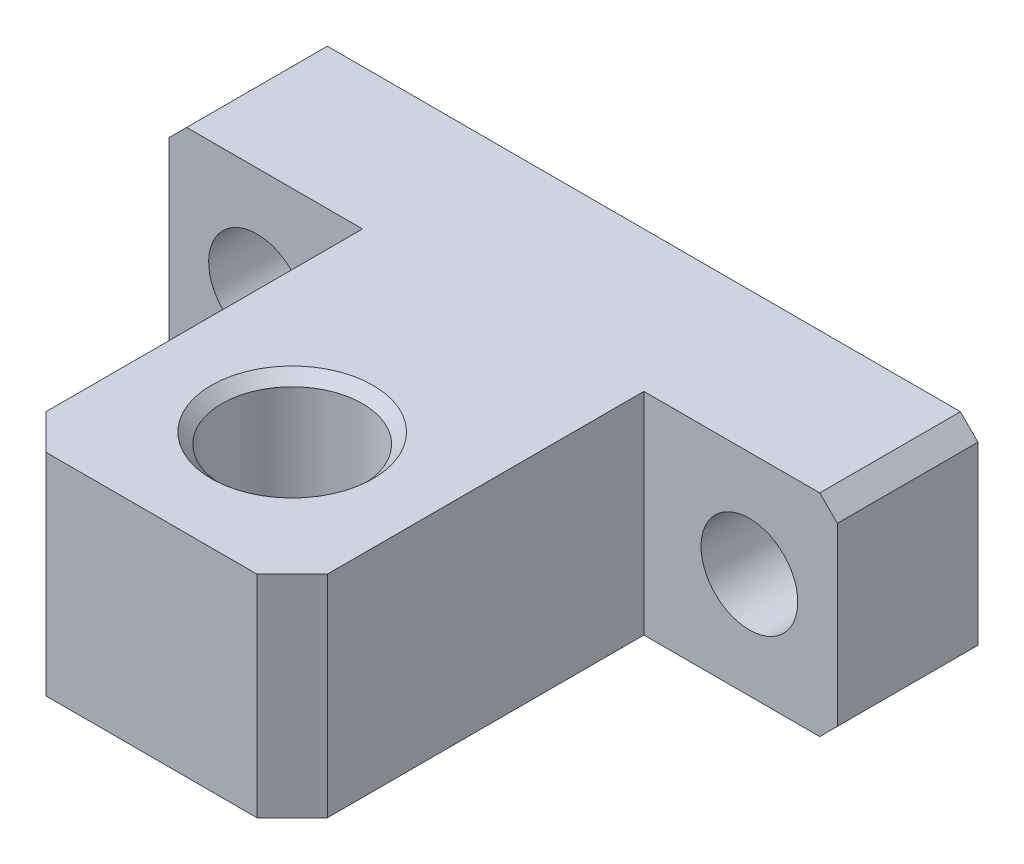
ISO-10303-21;
HEADER;
FILE_DESCRIPTION(('STEP AP214'),'2;1');
FILE_NAME('part.step','',(''),(''),'','','');
FILE_SCHEMA(('AUTOMOTIVE_DESIGN { 1 0 10303 214 1 1 1 1 }'));
ENDSEC;
DATA;
#1=APPLICATION_CONTEXT('core data for automotive mechanical design processes');
#2=APPLICATION_PROTOCOL_DEFINITION('international standard','automotive_design',2000,#1);
#3=PRODUCT_CONTEXT('',#1,'mechanical');
#4=PRODUCT('Part','Part','',(#3));
#5=PRODUCT_RELATED_PRODUCT_CATEGORY('part','',(#4));
#6=PRODUCT_DEFINITION_FORMATION('','',#4);
#7=PRODUCT_DEFINITION_CONTEXT('part definition',#1,'design');
#8=PRODUCT_DEFINITION('design','',#6,#7);
#9=PRODUCT_DEFINITION_SHAPE('','',#8);
#10=(LENGTH_UNIT() NAMED_UNIT(*) SI_UNIT(.MILLI.,.METRE.));
#11=(NAMED_UNIT(*) PLANE_ANGLE_UNIT() SI_UNIT($,.RADIAN.));
#12=(NAMED_UNIT(*) SI_UNIT($,.STERADIAN.) SOLID_ANGLE_UNIT());
#13=UNCERTAINTY_MEASURE_WITH_UNIT(LENGTH_MEASURE(1.E-05),#10,'distance_accuracy_value','');
#14=(GEOMETRIC_REPRESENTATION_CONTEXT(3) GLOBAL_UNCERTAINTY_ASSIGNED_CONTEXT((#13)) GLOBAL_UNIT_ASSIGNED_CONTEXT((#10,
#11,#12)) REPRESENTATION_CONTEXT('',''));
#15=CARTESIAN_POINT('',(0.,0.,0.));
#16=DIRECTION('',(0.,0.,1.));
#17=DIRECTION('',(1.,0.,0.));
#18=AXIS2_PLACEMENT_3D('',#15,#16,#17);
#19=CARTESIAN_POINT('',(-5.,6.,8.));
#20=DIRECTION('',(-1.,0.,0.));
#21=DIRECTION('',(0.,0.,-1.));
#22=AXIS2_PLACEMENT_3D('',#19,#20,#21);
#23=PLANE('',#22);
#24=DIRECTION('',(0.,-1.,0.));
#25=VECTOR('',#24,1.);
#26=CARTESIAN_POINT('',(-5.,6.,0.));
#27=LINE('',#26,#25);
#28=CARTESIAN_POINT('',(-5.,5.,0.));
#29=VERTEX_POINT('',#28);
#30=CARTESIAN_POINT('',(-5.,-5.,0.));
#31=VERTEX_POINT('',#30);
#32=EDGE_CURVE('E152',#29,#31,#27,.T.);
#33=ORIENTED_EDGE('',*,*,#32,.T.);
#34=DIRECTION('',(0.,0.,1.));
#35=VECTOR('',#34,1.);
#36=CARTESIAN_POINT('',(-5.,-5.,8.));
#37=LINE('',#36,#35);
#38=CARTESIAN_POINT('',(-5.,-5.,8.));
#39=VERTEX_POINT('',#38);
#40=EDGE_CURVE('E209',#31,#39,#37,.T.);
#41=ORIENTED_EDGE('',*,*,#40,.T.);
#42=DIRECTION('',(0.,-1.,0.));
#43=VECTOR('',#42,1.);
#44=CARTESIAN_POINT('',(-5.,6.,8.));
#45=LINE('',#44,#43);
#46=CARTESIAN_POINT('',(-5.,5.,8.));
#47=VERTEX_POINT('',#46);
#48=EDGE_CURVE('E168',#47,#39,#45,.T.);
#49=ORIENTED_EDGE('',*,*,#48,.F.);
#50=DIRECTION('',(0.,0.,-1.));
#51=VECTOR('',#50,1.);
#52=CARTESIAN_POINT('',(-5.,5.,8.));
#53=LINE('',#52,#51);
#54=EDGE_CURVE('E206',#47,#29,#53,.T.);
#55=ORIENTED_EDGE('',*,*,#54,.T.);
#56=EDGE_LOOP('',(#33,#41,#49,#55));
#57=FACE_BOUND('',#56,.T.);
#58=ADVANCED_FACE('F14',(#57),#23,.T.);
#59=CARTESIAN_POINT('',(6.,6.,8.));
#60=DIRECTION('',(0.,0.,1.));
#61=DIRECTION('',(-1.,0.,0.));
#62=AXIS2_PLACEMENT_3D('',#59,#60,#61);
#63=PLANE('',#62);
#64=CARTESIAN_POINT('',(0.,0.,8.));
#65=DIRECTION('',(0.,0.,1.));
#66=DIRECTION('',(0.,-1.,0.));
#67=AXIS2_PLACEMENT_3D('',#64,#65,#66);
#68=CIRCLE('',#67,2.75);
#69=CARTESIAN_POINT('',(0.,-2.75,8.));
#70=VERTEX_POINT('',#69);
#71=EDGE_CURVE('E317',#70,#70,#68,.T.);
#72=ORIENTED_EDGE('',*,*,#71,.F.);
#73=EDGE_LOOP('',(#72));
#74=FACE_BOUND('',#73,.T.);
#75=ORIENTED_EDGE('',*,*,#48,.T.);
#76=DIRECTION('',(0.707106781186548,-0.707106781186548,0.));
#77=VECTOR('',#76,1.);
#78=CARTESIAN_POINT('',(-5.,-5.,8.));
#79=LINE('',#78,#77);
#80=CARTESIAN_POINT('',(-4.,-6.,8.));
#81=VERTEX_POINT('',#80);
#82=EDGE_CURVE('E213',#39,#81,#79,.T.);
#83=ORIENTED_EDGE('',*,*,#82,.T.);
#84=DIRECTION('',(-1.,0.,0.));
#85=VECTOR('',#84,1.);
#86=CARTESIAN_POINT('',(6.,-6.,8.));
#87=LINE('',#86,#85);
#88=CARTESIAN_POINT('',(6.,-6.,8.));
#89=VERTEX_POINT('',#88);
#90=EDGE_CURVE('E165',#89,#81,#87,.T.);
#91=ORIENTED_EDGE('',*,*,#90,.F.);
#92=DIRECTION('',(0.,-1.,0.));
#93=VECTOR('',#92,1.);
#94=CARTESIAN_POINT('',(6.,6.,8.));
#95=LINE('',#94,#93);
#96=CARTESIAN_POINT('',(6.,6.,8.));
#97=VERTEX_POINT('',#96);
#98=EDGE_CURVE('E137',#97,#89,#95,.T.);
#99=ORIENTED_EDGE('',*,*,#98,.F.);
#100=DIRECTION('',(-1.,0.,0.));
#101=VECTOR('',#100,1.);
#102=CARTESIAN_POINT('',(6.,6.,8.));
#103=LINE('',#102,#101);
#104=CARTESIAN_POINT('',(-4.,6.,8.));
#105=VERTEX_POINT('',#104);
#106=EDGE_CURVE('E149',#97,#105,#103,.T.);
#107=ORIENTED_EDGE('',*,*,#106,.T.);
#108=DIRECTION('',(0.707106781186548,0.707106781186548,0.));
#109=VECTOR('',#108,1.);
#110=CARTESIAN_POINT('',(1.,11.,8.));
#111=LINE('',#110,#109);
#112=EDGE_CURVE('E211',#105,#47,#111,.F.);
#113=ORIENTED_EDGE('',*,*,#112,.T.);
#114=EDGE_LOOP('',(#75,#83,#91,#99,#107,#113));
#115=FACE_BOUND('',#114,.T.);
#116=ADVANCED_FACE('F250',(#74,#115),#63,.T.);
#117=CARTESIAN_POINT('',(6.,6.,28.));
#118=DIRECTION('',(-1.,0.,0.));
#119=DIRECTION('',(0.,0.,-1.));
#120=AXIS2_PLACEMENT_3D('',#117,#118,#119);
#121=PLANE('',#120);
#122=DIRECTION('',(0.,0.,-1.));
#123=VECTOR('',#122,1.);
#124=CARTESIAN_POINT('',(6.,-6.,28.));
#125=LINE('',#124,#123);
#126=CARTESIAN_POINT('',(6.,-6.,26.));
#127=VERTEX_POINT('',#126);
#128=EDGE_CURVE('E163',#127,#89,#125,.T.);
#129=ORIENTED_EDGE('',*,*,#128,.F.);
#130=DIRECTION('',(0.,1.,0.));
#131=VECTOR('',#130,1.);
#132=CARTESIAN_POINT('',(6.,6.,26.));
#133=LINE('',#132,#131);
#134=CARTESIAN_POINT('',(6.,6.,26.));
#135=VERTEX_POINT('',#134);
#136=EDGE_CURVE('E38',#127,#135,#133,.T.);
#137=ORIENTED_EDGE('',*,*,#136,.T.);
#138=DIRECTION('',(0.,0.,-1.));
#139=VECTOR('',#138,1.);
#140=CARTESIAN_POINT('',(6.,6.,28.));
#141=LINE('',#140,#139);
#142=EDGE_CURVE('E144',#135,#97,#141,.T.);
#143=ORIENTED_EDGE('',*,*,#142,.T.);
#144=ORIENTED_EDGE('',*,*,#98,.T.);
#145=EDGE_LOOP('',(#129,#137,#143,#144));
#146=FACE_BOUND('',#145,.T.);
#147=ADVANCED_FACE('F256',(#146),#121,.T.);
#148=CARTESIAN_POINT('',(22.,6.,28.));
#149=DIRECTION('',(0.,0.,1.));
#150=DIRECTION('',(0.,-1.,0.));
#151=AXIS2_PLACEMENT_3D('',#148,#149,#150);
#152=PLANE('',#151);
#153=DIRECTION('',(-1.,0.,0.));
#154=VECTOR('',#153,1.);
#155=CARTESIAN_POINT('',(22.,6.,28.));
#156=LINE('',#155,#154);
#157=CARTESIAN_POINT('',(20.,6.,28.));
#158=VERTEX_POINT('',#157);
#159=CARTESIAN_POINT('',(8.,6.,28.));
#160=VERTEX_POINT('',#159);
#161=EDGE_CURVE('E141',#158,#160,#156,.T.);
#162=ORIENTED_EDGE('',*,*,#161,.T.);
#163=DIRECTION('',(0.,-1.,0.));
#164=VECTOR('',#163,1.);
#165=CARTESIAN_POINT('',(8.,6.,28.));
#166=LINE('',#165,#164);
#167=CARTESIAN_POINT('',(8.,-6.,28.));
#168=VERTEX_POINT('',#167);
#169=EDGE_CURVE('E217',#160,#168,#166,.T.);
#170=ORIENTED_EDGE('',*,*,#169,.T.);
#171=DIRECTION('',(-1.,0.,0.));
#172=VECTOR('',#171,1.);
#173=CARTESIAN_POINT('',(22.,-6.,28.));
#174=LINE('',#173,#172);
#175=CARTESIAN_POINT('',(20.,-6.,28.));
#176=VERTEX_POINT('',#175);
#177=EDGE_CURVE('E160',#176,#168,#174,.T.);
#178=ORIENTED_EDGE('',*,*,#177,.F.);
#179=DIRECTION('',(0.,1.,0.));
#180=VECTOR('',#179,1.);
#181=CARTESIAN_POINT('',(20.,6.,28.));
#182=LINE('',#181,#180);
#183=EDGE_CURVE('E215',#176,#158,#182,.T.);
#184=ORIENTED_EDGE('',*,*,#183,.T.);
#185=EDGE_LOOP('',(#162,#170,#178,#184));
#186=FACE_BOUND('',#185,.T.);
#187=ADVANCED_FACE('F288',(#186),#152,.T.);
#188=CARTESIAN_POINT('',(22.,6.,8.));
#189=DIRECTION('',(1.,0.,0.));
#190=DIRECTION('',(0.,0.,1.));
#191=AXIS2_PLACEMENT_3D('',#188,#189,#190);
#192=PLANE('',#191);
#193=DIRECTION('',(0.,0.,1.));
#194=VECTOR('',#193,1.);
#195=CARTESIAN_POINT('',(22.,6.,8.));
#196=LINE('',#195,#194);
#197=CARTESIAN_POINT('',(22.,6.,8.));
#198=VERTEX_POINT('',#197);
#199=CARTESIAN_POINT('',(22.,6.,26.));
#200=VERTEX_POINT('',#199);
#201=EDGE_CURVE('E128',#198,#200,#196,.T.);
#202=ORIENTED_EDGE('',*,*,#201,.T.);
#203=DIRECTION('',(0.,-1.,0.));
#204=VECTOR('',#203,1.);
#205=CARTESIAN_POINT('',(22.,6.,26.));
#206=LINE('',#205,#204);
#207=CARTESIAN_POINT('',(22.,-6.,26.));
#208=VERTEX_POINT('',#207);
#209=EDGE_CURVE('E228',#200,#208,#206,.T.);
#210=ORIENTED_EDGE('',*,*,#209,.T.);
#211=DIRECTION('',(0.,0.,1.));
#212=VECTOR('',#211,1.);
#213=CARTESIAN_POINT('',(22.,-6.,8.));
#214=LINE('',#213,#212);
#215=CARTESIAN_POINT('',(22.,-6.,8.));
#216=VERTEX_POINT('',#215);
#217=EDGE_CURVE('E136',#216,#208,#214,.T.);
#218=ORIENTED_EDGE('',*,*,#217,.F.);
#219=DIRECTION('',(0.,-1.,0.));
#220=VECTOR('',#219,1.);
#221=CARTESIAN_POINT('',(22.,6.,8.));
#222=LINE('',#221,#220);
#223=EDGE_CURVE('E123',#198,#216,#222,.T.);
#224=ORIENTED_EDGE('',*,*,#223,.F.);
#225=EDGE_LOOP('',(#202,#210,#218,#224));
#226=FACE_BOUND('',#225,.T.);
#227=ADVANCED_FACE('F132',(#226),#192,.T.);
#228=CARTESIAN_POINT('',(33.,6.,8.));
#229=DIRECTION('',(0.,0.,1.));
#230=DIRECTION('',(-1.,0.,0.));
#231=AXIS2_PLACEMENT_3D('',#228,#229,#230);
#232=PLANE('',#231);
#233=CARTESIAN_POINT('',(28.,0.,8.));
#234=DIRECTION('',(0.,0.,1.));
#235=DIRECTION('',(0.,-1.,0.));
#236=AXIS2_PLACEMENT_3D('',#233,#234,#235);
#237=CIRCLE('',#236,2.75);
#238=CARTESIAN_POINT('',(28.,-2.75,8.));
#239=VERTEX_POINT('',#238);
#240=EDGE_CURVE('E323',#239,#239,#237,.T.);
#241=ORIENTED_EDGE('',*,*,#240,.F.);
#242=EDGE_LOOP('',(#241));
#243=FACE_BOUND('',#242,.T.);
#244=DIRECTION('',(-1.,0.,0.));
#245=VECTOR('',#244,1.);
#246=CARTESIAN_POINT('',(33.,-6.,8.));
#247=LINE('',#246,#245);
#248=CARTESIAN_POINT('',(32.,-6.,8.));
#249=VERTEX_POINT('',#248);
#250=EDGE_CURVE('E156',#249,#216,#247,.T.);
#251=ORIENTED_EDGE('',*,*,#250,.F.);
#252=DIRECTION('',(0.70710678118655,0.707106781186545,0.));
#253=VECTOR('',#252,1.);
#254=CARTESIAN_POINT('',(38.5,0.499999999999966,8.));
#255=LINE('',#254,#253);
#256=CARTESIAN_POINT('',(33.,-5.,8.));
#257=VERTEX_POINT('',#256);
#258=EDGE_CURVE('E187',#249,#257,#255,.T.);
#259=ORIENTED_EDGE('',*,*,#258,.T.);
#260=DIRECTION('',(0.,-1.,0.));
#261=VECTOR('',#260,1.);
#262=CARTESIAN_POINT('',(33.,6.,8.));
#263=LINE('',#262,#261);
#264=CARTESIAN_POINT('',(33.,5.,8.));
#265=VERTEX_POINT('',#264);
#266=EDGE_CURVE('E138',#265,#257,#263,.T.);
#267=ORIENTED_EDGE('',*,*,#266,.F.);
#268=DIRECTION('',(0.707106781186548,-0.707106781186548,0.));
#269=VECTOR('',#268,1.);
#270=CARTESIAN_POINT('',(32.5,5.5,8.));
#271=LINE('',#270,#269);
#272=CARTESIAN_POINT('',(32.,6.,8.));
#273=VERTEX_POINT('',#272);
#274=EDGE_CURVE('E126',#265,#273,#271,.F.);
#275=ORIENTED_EDGE('',*,*,#274,.T.);
#276=DIRECTION('',(-1.,0.,0.));
#277=VECTOR('',#276,1.);
#278=CARTESIAN_POINT('',(33.,6.,8.));
#279=LINE('',#278,#277);
#280=EDGE_CURVE('E119',#273,#198,#279,.T.);
#281=ORIENTED_EDGE('',*,*,#280,.T.);
#282=ORIENTED_EDGE('',*,*,#223,.T.);
#283=EDGE_LOOP('',(#251,#259,#267,#275,#281,#282));
#284=FACE_BOUND('',#283,.T.);
#285=ADVANCED_FACE('F122',(#243,#284),#232,.T.);
#286=CARTESIAN_POINT('',(33.,6.,0.));
#287=DIRECTION('',(1.,0.,0.));
#288=DIRECTION('',(0.,0.,1.));
#289=AXIS2_PLACEMENT_3D('',#286,#287,#288);
#290=PLANE('',#289);
#291=ORIENTED_EDGE('',*,*,#266,.T.);
#292=DIRECTION('',(0.,0.,-1.));
#293=VECTOR('',#292,1.);
#294=CARTESIAN_POINT('',(33.,-5.,0.));
#295=LINE('',#294,#293);
#296=CARTESIAN_POINT('',(33.,-5.,0.));
#297=VERTEX_POINT('',#296);
#298=EDGE_CURVE('E192',#257,#297,#295,.T.);
#299=ORIENTED_EDGE('',*,*,#298,.T.);
#300=DIRECTION('',(0.,-1.,0.));
#301=VECTOR('',#300,1.);
#302=CARTESIAN_POINT('',(33.,6.,0.));
#303=LINE('',#302,#301);
#304=CARTESIAN_POINT('',(33.,5.,0.));
#305=VERTEX_POINT('',#304);
#306=EDGE_CURVE('E176',#305,#297,#303,.T.);
#307=ORIENTED_EDGE('',*,*,#306,.F.);
#308=DIRECTION('',(0.,0.,1.));
#309=VECTOR('',#308,1.);
#310=CARTESIAN_POINT('',(33.,5.,0.));
#311=LINE('',#310,#309);
#312=EDGE_CURVE('E189',#305,#265,#311,.T.);
#313=ORIENTED_EDGE('',*,*,#312,.T.);
#314=EDGE_LOOP('',(#291,#299,#307,#313));
#315=FACE_BOUND('',#314,.T.);
#316=ADVANCED_FACE('F296',(#315),#290,.T.);
#317=CARTESIAN_POINT('',(-5.,6.,0.));
#318=DIRECTION('',(0.,0.,-1.));
#319=DIRECTION('',(0.,1.,0.));
#320=AXIS2_PLACEMENT_3D('',#317,#318,#319);
#321=PLANE('',#320);
#322=CARTESIAN_POINT('',(28.,0.,0.));
#323=DIRECTION('',(0.,0.,-1.));
#324=DIRECTION('',(0.,1.,0.));
#325=AXIS2_PLACEMENT_3D('',#322,#323,#324);
#326=CIRCLE('',#325,2.75);
#327=CARTESIAN_POINT('',(28.,2.75,0.));
#328=VERTEX_POINT('',#327);
#329=EDGE_CURVE('E320',#328,#328,#326,.T.);
#330=ORIENTED_EDGE('',*,*,#329,.F.);
#331=EDGE_LOOP('',(#330));
#332=FACE_BOUND('',#331,.T.);
#333=CARTESIAN_POINT('',(0.,0.,0.));
#334=DIRECTION('',(0.,0.,-1.));
#335=DIRECTION('',(0.,1.,0.));
#336=AXIS2_PLACEMENT_3D('',#333,#334,#335);
#337=CIRCLE('',#336,2.75);
#338=CARTESIAN_POINT('',(0.,2.75,0.));
#339=VERTEX_POINT('',#338);
#340=EDGE_CURVE('E157',#339,#339,#337,.T.);
#341=ORIENTED_EDGE('',*,*,#340,.F.);
#342=EDGE_LOOP('',(#341));
#343=FACE_BOUND('',#342,.T.);
#344=ORIENTED_EDGE('',*,*,#306,.T.);
#345=DIRECTION('',(-0.70710678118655,-0.707106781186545,0.));
#346=VECTOR('',#345,1.);
#347=CARTESIAN_POINT('',(19.5,-18.5,0.));
#348=LINE('',#347,#346);
#349=CARTESIAN_POINT('',(32.,-6.,0.));
#350=VERTEX_POINT('',#349);
#351=EDGE_CURVE('E200',#297,#350,#348,.T.);
#352=ORIENTED_EDGE('',*,*,#351,.T.);
#353=DIRECTION('',(1.,0.,0.));
#354=VECTOR('',#353,1.);
#355=CARTESIAN_POINT('',(-5.,-6.,0.));
#356=LINE('',#355,#354);
#357=CARTESIAN_POINT('',(-4.,-6.,0.));
#358=VERTEX_POINT('',#357);
#359=EDGE_CURVE('E153',#358,#350,#356,.T.);
#360=ORIENTED_EDGE('',*,*,#359,.F.);
#361=DIRECTION('',(-0.707106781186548,0.707106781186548,0.));
#362=VECTOR('',#361,1.);
#363=CARTESIAN_POINT('',(-10.5,0.5,0.));
#364=LINE('',#363,#362);
#365=EDGE_CURVE('E196',#358,#31,#364,.T.);
#366=ORIENTED_EDGE('',*,*,#365,.T.);
#367=ORIENTED_EDGE('',*,*,#32,.F.);
#368=DIRECTION('',(-0.707106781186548,-0.707106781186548,0.));
#369=VECTOR('',#368,1.);
#370=CARTESIAN_POINT('',(-4.5,5.5,0.));
#371=LINE('',#370,#369);
#372=CARTESIAN_POINT('',(-4.,6.,0.));
#373=VERTEX_POINT('',#372);
#374=EDGE_CURVE('E194',#29,#373,#371,.F.);
#375=ORIENTED_EDGE('',*,*,#374,.T.);
#376=DIRECTION('',(1.,0.,0.));
#377=VECTOR('',#376,1.);
#378=CARTESIAN_POINT('',(-5.,6.,0.));
#379=LINE('',#378,#377);
#380=CARTESIAN_POINT('',(32.,6.,0.));
#381=VERTEX_POINT('',#380);
#382=EDGE_CURVE('E129',#373,#381,#379,.T.);
#383=ORIENTED_EDGE('',*,*,#382,.T.);
#384=DIRECTION('',(-0.707106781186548,0.707106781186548,0.));
#385=VECTOR('',#384,1.);
#386=CARTESIAN_POINT('',(13.5,24.5,0.));
#387=LINE('',#386,#385);
#388=EDGE_CURVE('E198',#381,#305,#387,.F.);
#389=ORIENTED_EDGE('',*,*,#388,.T.);
#390=EDGE_LOOP('',(#344,#352,#360,#366,#367,#375,#383,#389));
#391=FACE_BOUND('',#390,.T.);
#392=ADVANCED_FACE('F261',(#332,#343,#391),#321,.T.);
#393=CARTESIAN_POINT('',(-5.,6.,8.));
#394=DIRECTION('',(0.,1.,0.));
#395=DIRECTION('',(-1.,0.,0.));
#396=AXIS2_PLACEMENT_3D('',#393,#394,#395);
#397=PLANE('',#396);
#398=CARTESIAN_POINT('',(14.,6.,20.));
#399=DIRECTION('',(0.,1.,0.));
#400=DIRECTION('',(-1.,0.,0.));
#401=AXIS2_PLACEMENT_3D('',#398,#399,#400);
#402=CIRCLE('',#401,4.6);
#403=CARTESIAN_POINT('',(9.4,6.,20.));
#404=VERTEX_POINT('',#403);
#405=EDGE_CURVE('E23',#404,#404,#402,.F.);
#406=ORIENTED_EDGE('',*,*,#405,.T.);
#407=EDGE_LOOP('',(#406));
#408=FACE_BOUND('',#407,.T.);
#409=ORIENTED_EDGE('',*,*,#142,.F.);
#410=DIRECTION('',(-0.707106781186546,0.,-0.707106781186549));
#411=VECTOR('',#410,1.);
#412=CARTESIAN_POINT('',(-8.5,6.,11.5));
#413=LINE('',#412,#411);
#414=EDGE_CURVE('E226',#135,#160,#413,.F.);
#415=ORIENTED_EDGE('',*,*,#414,.T.);
#416=ORIENTED_EDGE('',*,*,#161,.F.);
#417=DIRECTION('',(-0.707106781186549,0.,0.707106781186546));
#418=VECTOR('',#417,1.);
#419=CARTESIAN_POINT('',(17.5,6.,30.5));
#420=LINE('',#419,#418);
#421=EDGE_CURVE('E30',#158,#200,#420,.F.);
#422=ORIENTED_EDGE('',*,*,#421,.T.);
#423=ORIENTED_EDGE('',*,*,#201,.F.);
#424=ORIENTED_EDGE('',*,*,#280,.F.);
#425=DIRECTION('',(0.,0.,-1.));
#426=VECTOR('',#425,1.);
#427=CARTESIAN_POINT('',(32.,6.,8.));
#428=LINE('',#427,#426);
#429=EDGE_CURVE('E204',#273,#381,#428,.T.);
#430=ORIENTED_EDGE('',*,*,#429,.T.);
#431=ORIENTED_EDGE('',*,*,#382,.F.);
#432=DIRECTION('',(0.,0.,1.));
#433=VECTOR('',#432,1.);
#434=CARTESIAN_POINT('',(-4.,6.,8.));
#435=LINE('',#434,#433);
#436=EDGE_CURVE('E202',#373,#105,#435,.T.);
#437=ORIENTED_EDGE('',*,*,#436,.T.);
#438=ORIENTED_EDGE('',*,*,#106,.F.);
#439=EDGE_LOOP('',(#409,#415,#416,#422,#423,#424,#430,#431,#437,#438));
#440=FACE_BOUND('',#439,.T.);
#441=ADVANCED_FACE('F140',(#408,#440),#397,.T.);
#442=CARTESIAN_POINT('',(-5.,-6.,8.));
#443=DIRECTION('',(0.,1.,0.));
#444=DIRECTION('',(-1.,0.,0.));
#445=AXIS2_PLACEMENT_3D('',#442,#443,#444);
#446=PLANE('',#445);
#447=CARTESIAN_POINT('',(14.,-6.,20.));
#448=DIRECTION('',(0.,1.,0.));
#449=DIRECTION('',(-1.,0.,0.));
#450=AXIS2_PLACEMENT_3D('',#447,#448,#449);
#451=CIRCLE('',#450,4.6);
#452=CARTESIAN_POINT('',(9.4,-6.,20.));
#453=VERTEX_POINT('',#452);
#454=EDGE_CURVE('E9',#453,#453,#451,.T.);
#455=ORIENTED_EDGE('',*,*,#454,.T.);
#456=EDGE_LOOP('',(#455));
#457=FACE_BOUND('',#456,.T.);
#458=ORIENTED_EDGE('',*,*,#177,.T.);
#459=DIRECTION('',(0.707106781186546,0.,0.707106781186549));
#460=VECTOR('',#459,1.);
#461=CARTESIAN_POINT('',(8.,-6.,28.));
#462=LINE('',#461,#460);
#463=EDGE_CURVE('E222',#168,#127,#462,.F.);
#464=ORIENTED_EDGE('',*,*,#463,.T.);
#465=ORIENTED_EDGE('',*,*,#128,.T.);
#466=ORIENTED_EDGE('',*,*,#90,.T.);
#467=DIRECTION('',(0.,0.,-1.));
#468=VECTOR('',#467,1.);
#469=CARTESIAN_POINT('',(-4.,-6.,0.));
#470=LINE('',#469,#468);
#471=EDGE_CURVE('E171',#81,#358,#470,.T.);
#472=ORIENTED_EDGE('',*,*,#471,.T.);
#473=ORIENTED_EDGE('',*,*,#359,.T.);
#474=DIRECTION('',(0.,0.,1.));
#475=VECTOR('',#474,1.);
#476=CARTESIAN_POINT('',(32.,-6.,8.));
#477=LINE('',#476,#475);
#478=EDGE_CURVE('E183',#350,#249,#477,.T.);
#479=ORIENTED_EDGE('',*,*,#478,.T.);
#480=ORIENTED_EDGE('',*,*,#250,.T.);
#481=ORIENTED_EDGE('',*,*,#217,.T.);
#482=DIRECTION('',(0.707106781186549,0.,-0.707106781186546));
#483=VECTOR('',#482,1.);
#484=CARTESIAN_POINT('',(22.,-6.,26.));
#485=LINE('',#484,#483);
#486=EDGE_CURVE('E220',#208,#176,#485,.F.);
#487=ORIENTED_EDGE('',*,*,#486,.T.);
#488=EDGE_LOOP('',(#458,#464,#465,#466,#472,#473,#479,#480,#481,#487));
#489=FACE_BOUND('',#488,.T.);
#490=ADVANCED_FACE('F292',(#457,#489),#446,.F.);
#491=CARTESIAN_POINT('',(0.,0.,8.));
#492=DIRECTION('',(0.,0.,1.));
#493=DIRECTION('',(0.,-1.,0.));
#494=AXIS2_PLACEMENT_3D('',#491,#492,#493);
#495=CYLINDRICAL_SURFACE('',#494,2.75);
#496=ORIENTED_EDGE('',*,*,#71,.T.);
#497=EDGE_LOOP('',(#496));
#498=FACE_BOUND('',#497,.T.);
#499=ORIENTED_EDGE('',*,*,#340,.T.);
#500=EDGE_LOOP('',(#499));
#501=FACE_BOUND('',#500,.T.);
#502=ADVANCED_FACE('F336',(#498,#501),#495,.F.);
#503=CARTESIAN_POINT('',(28.,0.,8.));
#504=DIRECTION('',(0.,0.,1.));
#505=DIRECTION('',(0.,-1.,0.));
#506=AXIS2_PLACEMENT_3D('',#503,#504,#505);
#507=CYLINDRICAL_SURFACE('',#506,2.75);
#508=ORIENTED_EDGE('',*,*,#240,.T.);
#509=EDGE_LOOP('',(#508));
#510=FACE_BOUND('',#509,.T.);
#511=ORIENTED_EDGE('',*,*,#329,.T.);
#512=EDGE_LOOP('',(#511));
#513=FACE_BOUND('',#512,.T.);
#514=ADVANCED_FACE('F267',(#510,#513),#507,.F.);
#515=CARTESIAN_POINT('',(32.,-6.,8.));
#516=DIRECTION('',(0.707106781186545,-0.70710678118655,0.));
#517=DIRECTION('',(0.70710678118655,0.707106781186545,0.));
#518=AXIS2_PLACEMENT_3D('',#515,#516,#517);
#519=PLANE('',#518);
#520=ORIENTED_EDGE('',*,*,#351,.F.);
#521=ORIENTED_EDGE('',*,*,#298,.F.);
#522=ORIENTED_EDGE('',*,*,#258,.F.);
#523=ORIENTED_EDGE('',*,*,#478,.F.);
#524=EDGE_LOOP('',(#520,#521,#522,#523));
#525=FACE_BOUND('',#524,.T.);
#526=ADVANCED_FACE('F263',(#525),#519,.T.);
#527=CARTESIAN_POINT('',(33.,5.,0.));
#528=DIRECTION('',(-0.707106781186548,-0.707106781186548,0.));
#529=DIRECTION('',(0.707106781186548,-0.707106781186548,0.));
#530=AXIS2_PLACEMENT_3D('',#527,#528,#529);
#531=PLANE('',#530);
#532=ORIENTED_EDGE('',*,*,#388,.F.);
#533=ORIENTED_EDGE('',*,*,#429,.F.);
#534=ORIENTED_EDGE('',*,*,#274,.F.);
#535=ORIENTED_EDGE('',*,*,#312,.F.);
#536=EDGE_LOOP('',(#532,#533,#534,#535));
#537=FACE_BOUND('',#536,.T.);
#538=ADVANCED_FACE('F266',(#537),#531,.F.);
#539=CARTESIAN_POINT('',(-4.,-6.,8.));
#540=DIRECTION('',(-0.707106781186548,-0.707106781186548,0.));
#541=DIRECTION('',(0.707106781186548,-0.707106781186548,0.));
#542=AXIS2_PLACEMENT_3D('',#539,#540,#541);
#543=PLANE('',#542);
#544=ORIENTED_EDGE('',*,*,#82,.F.);
#545=ORIENTED_EDGE('',*,*,#40,.F.);
#546=ORIENTED_EDGE('',*,*,#365,.F.);
#547=ORIENTED_EDGE('',*,*,#471,.F.);
#548=EDGE_LOOP('',(#544,#545,#546,#547));
#549=FACE_BOUND('',#548,.T.);
#550=ADVANCED_FACE('F271',(#549),#543,.T.);
#551=CARTESIAN_POINT('',(-5.,5.,8.));
#552=DIRECTION('',(0.707106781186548,-0.707106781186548,0.));
#553=DIRECTION('',(0.707106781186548,0.707106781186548,0.));
#554=AXIS2_PLACEMENT_3D('',#551,#552,#553);
#555=PLANE('',#554);
#556=ORIENTED_EDGE('',*,*,#112,.F.);
#557=ORIENTED_EDGE('',*,*,#436,.F.);
#558=ORIENTED_EDGE('',*,*,#374,.F.);
#559=ORIENTED_EDGE('',*,*,#54,.F.);
#560=EDGE_LOOP('',(#556,#557,#558,#559));
#561=FACE_BOUND('',#560,.T.);
#562=ADVANCED_FACE('F275',(#561),#555,.F.);
#563=CARTESIAN_POINT('',(8.,6.,28.));
#564=DIRECTION('',(0.707106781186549,0.,-0.707106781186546));
#565=DIRECTION('',(0.707106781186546,0.,0.707106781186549));
#566=AXIS2_PLACEMENT_3D('',#563,#564,#565);
#567=PLANE('',#566);
#568=ORIENTED_EDGE('',*,*,#414,.F.);
#569=ORIENTED_EDGE('',*,*,#136,.F.);
#570=ORIENTED_EDGE('',*,*,#463,.F.);
#571=ORIENTED_EDGE('',*,*,#169,.F.);
#572=EDGE_LOOP('',(#568,#569,#570,#571));
#573=FACE_BOUND('',#572,.T.);
#574=ADVANCED_FACE('F245',(#573),#567,.F.);
#575=CARTESIAN_POINT('',(22.,6.,26.));
#576=DIRECTION('',(-0.707106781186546,0.,-0.707106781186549));
#577=DIRECTION('',(0.707106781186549,0.,-0.707106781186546));
#578=AXIS2_PLACEMENT_3D('',#575,#576,#577);
#579=PLANE('',#578);
#580=ORIENTED_EDGE('',*,*,#421,.F.);
#581=ORIENTED_EDGE('',*,*,#183,.F.);
#582=ORIENTED_EDGE('',*,*,#486,.F.);
#583=ORIENTED_EDGE('',*,*,#209,.F.);
#584=EDGE_LOOP('',(#580,#581,#582,#583));
#585=FACE_BOUND('',#584,.T.);
#586=ADVANCED_FACE('F236',(#585),#579,.F.);
#587=CARTESIAN_POINT('',(14.,4.8,20.));
#588=DIRECTION('',(0.,1.,0.));
#589=DIRECTION('',(-1.,0.,0.));
#590=AXIS2_PLACEMENT_3D('',#587,#588,#589);
#591=CONICAL_SURFACE('',#590,3.4,0.78539816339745);
#592=CARTESIAN_POINT('',(14.,5.4,20.));
#593=DIRECTION('',(0.,1.,0.));
#594=DIRECTION('',(0.,0.,1.));
#595=AXIS2_PLACEMENT_3D('',#592,#593,#594);
#596=CIRCLE('',#595,4.);
#597=CARTESIAN_POINT('',(14.,5.4,24.));
#598=VERTEX_POINT('',#597);
#599=EDGE_CURVE('E326',#598,#598,#596,.T.);
#600=ORIENTED_EDGE('',*,*,#599,.F.);
#601=EDGE_LOOP('',(#600));
#602=FACE_BOUND('',#601,.T.);
#603=ORIENTED_EDGE('',*,*,#405,.F.);
#604=EDGE_LOOP('',(#603));
#605=FACE_BOUND('',#604,.T.);
#606=ADVANCED_FACE('F234',(#602,#605),#591,.F.);
#607=CARTESIAN_POINT('',(14.,-6.,20.));
#608=DIRECTION('',(0.,-1.,0.));
#609=DIRECTION('',(1.,0.,0.));
#610=AXIS2_PLACEMENT_3D('',#607,#608,#609);
#611=CONICAL_SURFACE('',#610,4.6,0.785398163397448);
#612=CARTESIAN_POINT('',(14.,-5.4,20.));
#613=DIRECTION('',(0.,-1.,0.));
#614=DIRECTION('',(0.,0.,-1.));
#615=AXIS2_PLACEMENT_3D('',#612,#613,#614);
#616=CIRCLE('',#615,4.);
#617=CARTESIAN_POINT('',(14.,-5.4,16.));
#618=VERTEX_POINT('',#617);
#619=EDGE_CURVE('E18',#618,#618,#616,.T.);
#620=ORIENTED_EDGE('',*,*,#619,.F.);
#621=EDGE_LOOP('',(#620));
#622=FACE_BOUND('',#621,.T.);
#623=ORIENTED_EDGE('',*,*,#454,.F.);
#624=EDGE_LOOP('',(#623));
#625=FACE_BOUND('',#624,.T.);
#626=ADVANCED_FACE('F16',(#622,#625),#611,.F.);
#627=CARTESIAN_POINT('',(14.,-6.,20.));
#628=DIRECTION('',(0.,1.,0.));
#629=DIRECTION('',(0.,0.,1.));
#630=AXIS2_PLACEMENT_3D('',#627,#628,#629);
#631=CYLINDRICAL_SURFACE('',#630,4.);
#632=ORIENTED_EDGE('',*,*,#599,.T.);
#633=EDGE_LOOP('',(#632));
#634=FACE_BOUND('',#633,.T.);
#635=ORIENTED_EDGE('',*,*,#619,.T.);
#636=EDGE_LOOP('',(#635));
#637=FACE_BOUND('',#636,.T.);
#638=ADVANCED_FACE('F243',(#634,#637),#631,.F.);
#639=CLOSED_SHELL('',(#58,#116,#147,#187,#227,#285,#316,#392,#441,#490,#502,#514,#526,#538,#550,
#562,#574,#586,#606,#626,#638));
#640=MANIFOLD_SOLID_BREP('B1',#639);
#641=ADVANCED_BREP_SHAPE_REPRESENTATION('',(#18,#640),#14);
#642=SHAPE_DEFINITION_REPRESENTATION(#9,#641);
ENDSEC;
END-ISO-10303-21;
